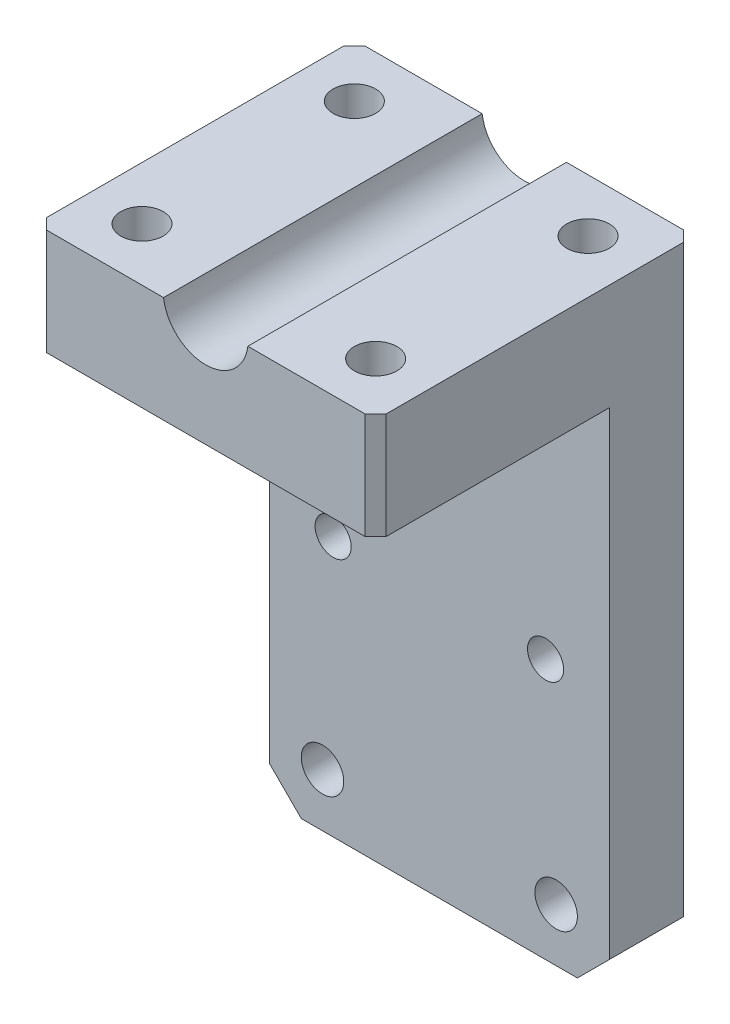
ISO-10303-21;
HEADER;
FILE_DESCRIPTION(('STEP AP214'),'2;1');
FILE_NAME('part.step','',(''),(''),'','','');
FILE_SCHEMA(('AUTOMOTIVE_DESIGN { 1 0 10303 214 1 1 1 1 }'));
ENDSEC;
DATA;
#1=APPLICATION_CONTEXT('core data for automotive mechanical design processes');
#2=APPLICATION_PROTOCOL_DEFINITION('international standard','automotive_design',2000,#1);
#3=PRODUCT_CONTEXT('',#1,'mechanical');
#4=PRODUCT('Part','Part','',(#3));
#5=PRODUCT_RELATED_PRODUCT_CATEGORY('part','',(#4));
#6=PRODUCT_DEFINITION_FORMATION('','',#4);
#7=PRODUCT_DEFINITION_CONTEXT('part definition',#1,'design');
#8=PRODUCT_DEFINITION('design','',#6,#7);
#9=PRODUCT_DEFINITION_SHAPE('','',#8);
#10=(LENGTH_UNIT() NAMED_UNIT(*) SI_UNIT(.MILLI.,.METRE.));
#11=(NAMED_UNIT(*) PLANE_ANGLE_UNIT() SI_UNIT($,.RADIAN.));
#12=(NAMED_UNIT(*) SI_UNIT($,.STERADIAN.) SOLID_ANGLE_UNIT());
#13=UNCERTAINTY_MEASURE_WITH_UNIT(LENGTH_MEASURE(1.E-05),#10,'distance_accuracy_value','');
#14=(GEOMETRIC_REPRESENTATION_CONTEXT(3) GLOBAL_UNCERTAINTY_ASSIGNED_CONTEXT((#13)) GLOBAL_UNIT_ASSIGNED_CONTEXT((#10,
#11,#12)) REPRESENTATION_CONTEXT('',''));
#15=CARTESIAN_POINT('',(0.,0.,0.));
#16=DIRECTION('',(0.,0.,1.));
#17=DIRECTION('',(1.,0.,0.));
#18=AXIS2_PLACEMENT_3D('',#15,#16,#17);
#19=CARTESIAN_POINT('',(-16.,29.,-30.));
#20=DIRECTION('',(0.,1.,0.));
#21=DIRECTION('',(0.,0.,1.));
#22=AXIS2_PLACEMENT_3D('',#19,#20,#21);
#23=PLANE('',#22);
#24=CARTESIAN_POINT('',(11.,29.,-25.));
#25=DIRECTION('',(0.,1.,0.));
#26=DIRECTION('',(0.,0.,1.));
#27=AXIS2_PLACEMENT_3D('',#24,#25,#26);
#28=CIRCLE('',#27,2.);
#29=CARTESIAN_POINT('',(11.,29.,-23.));
#30=VERTEX_POINT('',#29);
#31=EDGE_CURVE('E409',#30,#30,#28,.T.);
#32=ORIENTED_EDGE('',*,*,#31,.F.);
#33=EDGE_LOOP('',(#32));
#34=FACE_BOUND('',#33,.T.);
#35=CARTESIAN_POINT('',(11.,29.,-5.));
#36=DIRECTION('',(0.,1.,0.));
#37=DIRECTION('',(0.,0.,1.));
#38=AXIS2_PLACEMENT_3D('',#35,#36,#37);
#39=CIRCLE('',#38,2.);
#40=CARTESIAN_POINT('',(11.,29.,-3.));
#41=VERTEX_POINT('',#40);
#42=EDGE_CURVE('E419',#41,#41,#39,.T.);
#43=ORIENTED_EDGE('',*,*,#42,.F.);
#44=EDGE_LOOP('',(#43));
#45=FACE_BOUND('',#44,.T.);
#46=DIRECTION('',(0.,0.,1.));
#47=VECTOR('',#46,1.);
#48=CARTESIAN_POINT('',(16.,29.,-30.));
#49=LINE('',#48,#47);
#50=CARTESIAN_POINT('',(16.,29.,-29.));
#51=VERTEX_POINT('',#50);
#52=CARTESIAN_POINT('',(16.,29.,-1.00000000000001));
#53=VERTEX_POINT('',#52);
#54=EDGE_CURVE('E278',#51,#53,#49,.T.);
#55=ORIENTED_EDGE('',*,*,#54,.F.);
#56=DIRECTION('',(0.707106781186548,0.,0.707106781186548));
#57=VECTOR('',#56,1.);
#58=CARTESIAN_POINT('',(-0.500000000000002,29.,-45.5));
#59=LINE('',#58,#57);
#60=CARTESIAN_POINT('',(15.,29.,-30.));
#61=VERTEX_POINT('',#60);
#62=EDGE_CURVE('E368',#51,#61,#59,.F.);
#63=ORIENTED_EDGE('',*,*,#62,.T.);
#64=DIRECTION('',(-1.,0.,0.));
#65=VECTOR('',#64,1.);
#66=CARTESIAN_POINT('',(-16.,29.,-30.));
#67=LINE('',#66,#65);
#68=CARTESIAN_POINT('',(3.96862696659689,29.,-30.));
#69=VERTEX_POINT('',#68);
#70=EDGE_CURVE('E180',#61,#69,#67,.T.);
#71=ORIENTED_EDGE('',*,*,#70,.T.);
#72=DIRECTION('',(0.,0.,-1.));
#73=VECTOR('',#72,1.);
#74=CARTESIAN_POINT('',(3.96862696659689,29.,0.));
#75=LINE('',#74,#73);
#76=CARTESIAN_POINT('',(3.96862696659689,29.,0.));
#77=VERTEX_POINT('',#76);
#78=EDGE_CURVE('E171',#77,#69,#75,.T.);
#79=ORIENTED_EDGE('',*,*,#78,.F.);
#80=DIRECTION('',(-1.,0.,0.));
#81=VECTOR('',#80,1.);
#82=CARTESIAN_POINT('',(-16.,29.,0.));
#83=LINE('',#82,#81);
#84=CARTESIAN_POINT('',(15.,29.,0.));
#85=VERTEX_POINT('',#84);
#86=EDGE_CURVE('E154',#85,#77,#83,.T.);
#87=ORIENTED_EDGE('',*,*,#86,.F.);
#88=DIRECTION('',(0.707106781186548,0.,-0.707106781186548));
#89=VECTOR('',#88,1.);
#90=CARTESIAN_POINT('',(14.5,29.,0.499999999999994));
#91=LINE('',#90,#89);
#92=EDGE_CURVE('E365',#85,#53,#91,.T.);
#93=ORIENTED_EDGE('',*,*,#92,.T.);
#94=EDGE_LOOP('',(#55,#63,#71,#79,#87,#93));
#95=FACE_BOUND('',#94,.T.);
#96=ADVANCED_FACE('F42',(#34,#45,#95),#23,.T.);
#97=CARTESIAN_POINT('',(16.,-29.,-30.));
#98=DIRECTION('',(1.,0.,0.));
#99=DIRECTION('',(0.,0.,-1.));
#100=AXIS2_PLACEMENT_3D('',#97,#98,#99);
#101=PLANE('',#100);
#102=DIRECTION('',(0.,0.,-1.));
#103=VECTOR('',#102,1.);
#104=CARTESIAN_POINT('',(16.,-26.,-30.));
#105=LINE('',#104,#103);
#106=CARTESIAN_POINT('',(16.,-26.,-22.));
#107=VERTEX_POINT('',#106);
#108=CARTESIAN_POINT('',(16.,-26.,-29.));
#109=VERTEX_POINT('',#108);
#110=EDGE_CURVE('E318',#107,#109,#105,.T.);
#111=ORIENTED_EDGE('',*,*,#110,.T.);
#112=DIRECTION('',(0.,1.,0.));
#113=VECTOR('',#112,1.);
#114=CARTESIAN_POINT('',(16.,-29.,-29.));
#115=LINE('',#114,#113);
#116=EDGE_CURVE('E362',#109,#51,#115,.T.);
#117=ORIENTED_EDGE('',*,*,#116,.T.);
#118=ORIENTED_EDGE('',*,*,#54,.T.);
#119=DIRECTION('',(0.,-1.,0.));
#120=VECTOR('',#119,1.);
#121=CARTESIAN_POINT('',(16.,19.,-1.00000000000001));
#122=LINE('',#121,#120);
#123=CARTESIAN_POINT('',(16.,19.,-1.00000000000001));
#124=VERTEX_POINT('',#123);
#125=EDGE_CURVE('E359',#53,#124,#122,.T.);
#126=ORIENTED_EDGE('',*,*,#125,.T.);
#127=DIRECTION('',(0.,0.,1.));
#128=VECTOR('',#127,1.);
#129=CARTESIAN_POINT('',(16.,19.,-22.));
#130=LINE('',#129,#128);
#131=CARTESIAN_POINT('',(16.,19.,-22.));
#132=VERTEX_POINT('',#131);
#133=EDGE_CURVE('E257',#132,#124,#130,.T.);
#134=ORIENTED_EDGE('',*,*,#133,.F.);
#135=DIRECTION('',(0.,1.,0.));
#136=VECTOR('',#135,1.);
#137=CARTESIAN_POINT('',(16.,-29.,-22.));
#138=LINE('',#137,#136);
#139=EDGE_CURVE('E262',#107,#132,#138,.T.);
#140=ORIENTED_EDGE('',*,*,#139,.F.);
#141=EDGE_LOOP('',(#111,#117,#118,#126,#134,#140));
#142=FACE_BOUND('',#141,.T.);
#143=ADVANCED_FACE('F511',(#142),#101,.T.);
#144=CARTESIAN_POINT('',(-16.,-29.,-30.));
#145=DIRECTION('',(0.,-1.,0.));
#146=DIRECTION('',(0.,0.,-1.));
#147=AXIS2_PLACEMENT_3D('',#144,#145,#146);
#148=PLANE('',#147);
#149=DIRECTION('',(0.,0.,-1.));
#150=VECTOR('',#149,1.);
#151=CARTESIAN_POINT('',(-13.,-29.,-30.));
#152=LINE('',#151,#150);
#153=CARTESIAN_POINT('',(-13.,-29.,-22.));
#154=VERTEX_POINT('',#153);
#155=CARTESIAN_POINT('',(-13.,-29.,-29.));
#156=VERTEX_POINT('',#155);
#157=EDGE_CURVE('E314',#154,#156,#152,.T.);
#158=ORIENTED_EDGE('',*,*,#157,.T.);
#159=DIRECTION('',(1.,0.,0.));
#160=VECTOR('',#159,1.);
#161=CARTESIAN_POINT('',(-16.,-29.,-29.));
#162=LINE('',#161,#160);
#163=CARTESIAN_POINT('',(13.,-29.,-29.));
#164=VERTEX_POINT('',#163);
#165=EDGE_CURVE('E353',#156,#164,#162,.T.);
#166=ORIENTED_EDGE('',*,*,#165,.T.);
#167=DIRECTION('',(0.,0.,1.));
#168=VECTOR('',#167,1.);
#169=CARTESIAN_POINT('',(13.,-29.,-30.));
#170=LINE('',#169,#168);
#171=CARTESIAN_POINT('',(13.,-29.,-22.));
#172=VERTEX_POINT('',#171);
#173=EDGE_CURVE('E311',#164,#172,#170,.T.);
#174=ORIENTED_EDGE('',*,*,#173,.T.);
#175=DIRECTION('',(1.,0.,0.));
#176=VECTOR('',#175,1.);
#177=CARTESIAN_POINT('',(-16.,-29.,-22.));
#178=LINE('',#177,#176);
#179=EDGE_CURVE('E267',#154,#172,#178,.T.);
#180=ORIENTED_EDGE('',*,*,#179,.F.);
#181=EDGE_LOOP('',(#158,#166,#174,#180));
#182=FACE_BOUND('',#181,.T.);
#183=ADVANCED_FACE('F499',(#182),#148,.T.);
#184=CARTESIAN_POINT('',(-16.,-29.,-30.));
#185=DIRECTION('',(-1.,0.,0.));
#186=DIRECTION('',(0.,0.,1.));
#187=AXIS2_PLACEMENT_3D('',#184,#185,#186);
#188=PLANE('',#187);
#189=DIRECTION('',(0.,0.,1.));
#190=VECTOR('',#189,1.);
#191=CARTESIAN_POINT('',(-16.,29.,-30.));
#192=LINE('',#191,#190);
#193=CARTESIAN_POINT('',(-16.,29.,-29.));
#194=VERTEX_POINT('',#193);
#195=CARTESIAN_POINT('',(-16.,29.,-1.00000000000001));
#196=VERTEX_POINT('',#195);
#197=EDGE_CURVE('E280',#194,#196,#192,.T.);
#198=ORIENTED_EDGE('',*,*,#197,.F.);
#199=DIRECTION('',(0.,-1.,0.));
#200=VECTOR('',#199,1.);
#201=CARTESIAN_POINT('',(-16.,-29.,-29.));
#202=LINE('',#201,#200);
#203=CARTESIAN_POINT('',(-16.,-26.,-29.));
#204=VERTEX_POINT('',#203);
#205=EDGE_CURVE('E325',#194,#204,#202,.T.);
#206=ORIENTED_EDGE('',*,*,#205,.T.);
#207=DIRECTION('',(0.,0.,1.));
#208=VECTOR('',#207,1.);
#209=CARTESIAN_POINT('',(-16.,-26.,-30.));
#210=LINE('',#209,#208);
#211=CARTESIAN_POINT('',(-16.,-26.,-22.));
#212=VERTEX_POINT('',#211);
#213=EDGE_CURVE('E284',#204,#212,#210,.T.);
#214=ORIENTED_EDGE('',*,*,#213,.T.);
#215=DIRECTION('',(0.,1.,0.));
#216=VECTOR('',#215,1.);
#217=CARTESIAN_POINT('',(-16.,-29.,-22.));
#218=LINE('',#217,#216);
#219=CARTESIAN_POINT('',(-16.,19.,-22.));
#220=VERTEX_POINT('',#219);
#221=EDGE_CURVE('E253',#212,#220,#218,.T.);
#222=ORIENTED_EDGE('',*,*,#221,.T.);
#223=DIRECTION('',(0.,0.,1.));
#224=VECTOR('',#223,1.);
#225=CARTESIAN_POINT('',(-16.,19.,-22.));
#226=LINE('',#225,#224);
#227=CARTESIAN_POINT('',(-16.,19.,-1.00000000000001));
#228=VERTEX_POINT('',#227);
#229=EDGE_CURVE('E256',#220,#228,#226,.T.);
#230=ORIENTED_EDGE('',*,*,#229,.T.);
#231=DIRECTION('',(0.,1.,0.));
#232=VECTOR('',#231,1.);
#233=CARTESIAN_POINT('',(-16.,29.,-1.00000000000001));
#234=LINE('',#233,#232);
#235=EDGE_CURVE('E322',#228,#196,#234,.T.);
#236=ORIENTED_EDGE('',*,*,#235,.T.);
#237=EDGE_LOOP('',(#198,#206,#214,#222,#230,#236));
#238=FACE_BOUND('',#237,.T.);
#239=ADVANCED_FACE('F483',(#238),#188,.T.);
#240=CARTESIAN_POINT('',(-11.,29.,-25.));
#241=DIRECTION('',(0.,1.,0.));
#242=DIRECTION('',(0.,0.,1.));
#243=AXIS2_PLACEMENT_3D('',#240,#241,#242);
#244=CIRCLE('',#243,2.);
#245=CARTESIAN_POINT('',(-11.,29.,-23.));
#246=VERTEX_POINT('',#245);
#247=EDGE_CURVE('E394',#246,#246,#244,.T.);
#248=ORIENTED_EDGE('',*,*,#247,.F.);
#249=EDGE_LOOP('',(#248));
#250=FACE_BOUND('',#249,.T.);
#251=CARTESIAN_POINT('',(-11.,29.,-5.));
#252=DIRECTION('',(0.,1.,0.));
#253=DIRECTION('',(0.,0.,1.));
#254=AXIS2_PLACEMENT_3D('',#251,#252,#253);
#255=CIRCLE('',#254,2.);
#256=CARTESIAN_POINT('',(-11.,29.,-3.));
#257=VERTEX_POINT('',#256);
#258=EDGE_CURVE('E427',#257,#257,#255,.T.);
#259=ORIENTED_EDGE('',*,*,#258,.F.);
#260=EDGE_LOOP('',(#259));
#261=FACE_BOUND('',#260,.T.);
#262=CARTESIAN_POINT('',(-3.96862696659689,29.,-30.));
#263=VERTEX_POINT('',#262);
#264=CARTESIAN_POINT('',(-15.,29.,-30.));
#265=VERTEX_POINT('',#264);
#266=EDGE_CURVE('E165',#263,#265,#67,.T.);
#267=ORIENTED_EDGE('',*,*,#266,.T.);
#268=DIRECTION('',(0.707106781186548,0.,-0.707106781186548));
#269=VECTOR('',#268,1.);
#270=CARTESIAN_POINT('',(-15.5,29.,-29.5));
#271=LINE('',#270,#269);
#272=EDGE_CURVE('E347',#265,#194,#271,.F.);
#273=ORIENTED_EDGE('',*,*,#272,.T.);
#274=ORIENTED_EDGE('',*,*,#197,.T.);
#275=DIRECTION('',(0.707106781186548,0.,0.707106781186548));
#276=VECTOR('',#275,1.);
#277=CARTESIAN_POINT('',(-30.5,29.,-15.5));
#278=LINE('',#277,#276);
#279=CARTESIAN_POINT('',(-15.,29.,0.));
#280=VERTEX_POINT('',#279);
#281=EDGE_CURVE('E344',#196,#280,#278,.T.);
#282=ORIENTED_EDGE('',*,*,#281,.T.);
#283=CARTESIAN_POINT('',(-3.96862696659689,29.,0.));
#284=VERTEX_POINT('',#283);
#285=EDGE_CURVE('E166',#284,#280,#83,.T.);
#286=ORIENTED_EDGE('',*,*,#285,.F.);
#287=DIRECTION('',(0.,0.,-1.));
#288=VECTOR('',#287,1.);
#289=CARTESIAN_POINT('',(-3.96862696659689,29.,0.));
#290=LINE('',#289,#288);
#291=EDGE_CURVE('E174',#263,#284,#290,.F.);
#292=ORIENTED_EDGE('',*,*,#291,.F.);
#293=EDGE_LOOP('',(#267,#273,#274,#282,#286,#292));
#294=FACE_BOUND('',#293,.T.);
#295=ADVANCED_FACE('F440',(#250,#261,#294),#23,.T.);
#296=CARTESIAN_POINT('',(0.,0.,-30.));
#297=DIRECTION('',(0.,0.,-1.));
#298=DIRECTION('',(-1.,0.,0.));
#299=AXIS2_PLACEMENT_3D('',#296,#297,#298);
#300=PLANE('',#299);
#301=DIRECTION('',(-0.707106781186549,0.707106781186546,0.));
#302=VECTOR('',#301,1.);
#303=CARTESIAN_POINT('',(-20.2928932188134,-20.2928932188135,-30.));
#304=LINE('',#303,#302);
#305=CARTESIAN_POINT('',(-12.5857864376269,-28.,-30.));
#306=VERTEX_POINT('',#305);
#307=CARTESIAN_POINT('',(-15.,-25.5857864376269,-30.));
#308=VERTEX_POINT('',#307);
#309=EDGE_CURVE('E338',#306,#308,#304,.T.);
#310=ORIENTED_EDGE('',*,*,#309,.T.);
#311=DIRECTION('',(0.,1.,0.));
#312=VECTOR('',#311,1.);
#313=CARTESIAN_POINT('',(-15.,0.,-30.));
#314=LINE('',#313,#312);
#315=EDGE_CURVE('E341',#308,#265,#314,.T.);
#316=ORIENTED_EDGE('',*,*,#315,.T.);
#317=ORIENTED_EDGE('',*,*,#266,.F.);
#318=CARTESIAN_POINT('',(0.,29.5,-30.));
#319=DIRECTION('',(0.,0.,-1.));
#320=DIRECTION('',(-1.,0.,0.));
#321=AXIS2_PLACEMENT_3D('',#318,#319,#320);
#322=CIRCLE('',#321,4.);
#323=EDGE_CURVE('E176',#69,#263,#322,.T.);
#324=ORIENTED_EDGE('',*,*,#323,.F.);
#325=ORIENTED_EDGE('',*,*,#70,.F.);
#326=DIRECTION('',(0.,-1.,0.));
#327=VECTOR('',#326,1.);
#328=CARTESIAN_POINT('',(15.,0.,-30.));
#329=LINE('',#328,#327);
#330=CARTESIAN_POINT('',(15.,-25.5857864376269,-30.));
#331=VERTEX_POINT('',#330);
#332=EDGE_CURVE('E329',#61,#331,#329,.T.);
#333=ORIENTED_EDGE('',*,*,#332,.T.);
#334=DIRECTION('',(-0.707106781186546,-0.707106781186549,0.));
#335=VECTOR('',#334,1.);
#336=CARTESIAN_POINT('',(20.2928932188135,-20.2928932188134,-30.));
#337=LINE('',#336,#335);
#338=CARTESIAN_POINT('',(12.5857864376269,-28.,-30.));
#339=VERTEX_POINT('',#338);
#340=EDGE_CURVE('E332',#331,#339,#337,.T.);
#341=ORIENTED_EDGE('',*,*,#340,.T.);
#342=DIRECTION('',(-1.,0.,0.));
#343=VECTOR('',#342,1.);
#344=CARTESIAN_POINT('',(0.,-28.,-30.));
#345=LINE('',#344,#343);
#346=EDGE_CURVE('E335',#339,#306,#345,.T.);
#347=ORIENTED_EDGE('',*,*,#346,.T.);
#348=EDGE_LOOP('',(#310,#316,#317,#324,#325,#333,#341,#347));
#349=FACE_BOUND('',#348,.T.);
#350=CARTESIAN_POINT('',(-11.,-24.,-30.));
#351=DIRECTION('',(0.,0.,-1.));
#352=DIRECTION('',(-1.,0.,0.));
#353=AXIS2_PLACEMENT_3D('',#350,#351,#352);
#354=CIRCLE('',#353,2.);
#355=CARTESIAN_POINT('',(-13.,-24.,-30.));
#356=VERTEX_POINT('',#355);
#357=EDGE_CURVE('E182',#356,#356,#354,.T.);
#358=ORIENTED_EDGE('',*,*,#357,.F.);
#359=EDGE_LOOP('',(#358));
#360=FACE_BOUND('',#359,.T.);
#361=CARTESIAN_POINT('',(11.,-24.,-30.));
#362=DIRECTION('',(0.,0.,-1.));
#363=DIRECTION('',(-1.,0.,0.));
#364=AXIS2_PLACEMENT_3D('',#361,#362,#363);
#365=CIRCLE('',#364,2.);
#366=CARTESIAN_POINT('',(9.,-24.,-30.));
#367=VERTEX_POINT('',#366);
#368=EDGE_CURVE('E193',#367,#367,#365,.T.);
#369=ORIENTED_EDGE('',*,*,#368,.F.);
#370=EDGE_LOOP('',(#369));
#371=FACE_BOUND('',#370,.T.);
#372=CARTESIAN_POINT('',(-10.,-4.5,-30.));
#373=DIRECTION('',(0.,0.,-1.));
#374=DIRECTION('',(-1.,0.,0.));
#375=AXIS2_PLACEMENT_3D('',#372,#373,#374);
#376=CIRCLE('',#375,3.5);
#377=CARTESIAN_POINT('',(-13.5,-4.5,-30.));
#378=VERTEX_POINT('',#377);
#379=EDGE_CURVE('E201',#378,#378,#376,.T.);
#380=ORIENTED_EDGE('',*,*,#379,.F.);
#381=EDGE_LOOP('',(#380));
#382=FACE_BOUND('',#381,.T.);
#383=CARTESIAN_POINT('',(10.,-4.5,-30.));
#384=DIRECTION('',(0.,0.,-1.));
#385=DIRECTION('',(-1.,0.,0.));
#386=AXIS2_PLACEMENT_3D('',#383,#384,#385);
#387=CIRCLE('',#386,3.5);
#388=CARTESIAN_POINT('',(6.5,-4.5,-30.));
#389=VERTEX_POINT('',#388);
#390=EDGE_CURVE('E214',#389,#389,#387,.T.);
#391=ORIENTED_EDGE('',*,*,#390,.F.);
#392=EDGE_LOOP('',(#391));
#393=FACE_BOUND('',#392,.T.);
#394=CARTESIAN_POINT('',(-10.,15.5,-30.));
#395=DIRECTION('',(0.,0.,-1.));
#396=DIRECTION('',(-1.,0.,0.));
#397=AXIS2_PLACEMENT_3D('',#394,#395,#396);
#398=CIRCLE('',#397,3.5);
#399=CARTESIAN_POINT('',(-13.5,15.5,-30.));
#400=VERTEX_POINT('',#399);
#401=EDGE_CURVE('E227',#400,#400,#398,.T.);
#402=ORIENTED_EDGE('',*,*,#401,.F.);
#403=EDGE_LOOP('',(#402));
#404=FACE_BOUND('',#403,.T.);
#405=CARTESIAN_POINT('',(10.,15.5,-30.));
#406=DIRECTION('',(0.,0.,-1.));
#407=DIRECTION('',(-1.,0.,0.));
#408=AXIS2_PLACEMENT_3D('',#405,#406,#407);
#409=CIRCLE('',#408,3.5);
#410=CARTESIAN_POINT('',(6.5,15.5,-30.));
#411=VERTEX_POINT('',#410);
#412=EDGE_CURVE('E240',#411,#411,#409,.T.);
#413=ORIENTED_EDGE('',*,*,#412,.F.);
#414=EDGE_LOOP('',(#413));
#415=FACE_BOUND('',#414,.T.);
#416=ADVANCED_FACE('F442',(#349,#360,#371,#382,#393,#404,#415),#300,.T.);
#417=CARTESIAN_POINT('',(0.,0.,0.));
#418=DIRECTION('',(0.,0.,-1.));
#419=DIRECTION('',(-1.,0.,0.));
#420=AXIS2_PLACEMENT_3D('',#417,#418,#419);
#421=PLANE('',#420);
#422=ORIENTED_EDGE('',*,*,#285,.T.);
#423=DIRECTION('',(0.,-1.,0.));
#424=VECTOR('',#423,1.);
#425=CARTESIAN_POINT('',(-15.,19.,0.));
#426=LINE('',#425,#424);
#427=CARTESIAN_POINT('',(-15.,19.,0.));
#428=VERTEX_POINT('',#427);
#429=EDGE_CURVE('E373',#280,#428,#426,.T.);
#430=ORIENTED_EDGE('',*,*,#429,.T.);
#431=DIRECTION('',(1.,0.,0.));
#432=VECTOR('',#431,1.);
#433=CARTESIAN_POINT('',(-16.,19.,0.));
#434=LINE('',#433,#432);
#435=CARTESIAN_POINT('',(15.,19.,0.));
#436=VERTEX_POINT('',#435);
#437=EDGE_CURVE('E271',#428,#436,#434,.T.);
#438=ORIENTED_EDGE('',*,*,#437,.T.);
#439=DIRECTION('',(0.,1.,0.));
#440=VECTOR('',#439,1.);
#441=CARTESIAN_POINT('',(15.,29.,0.));
#442=LINE('',#441,#440);
#443=EDGE_CURVE('E161',#436,#85,#442,.T.);
#444=ORIENTED_EDGE('',*,*,#443,.T.);
#445=ORIENTED_EDGE('',*,*,#86,.T.);
#446=CARTESIAN_POINT('',(0.,29.5,0.));
#447=DIRECTION('',(0.,0.,-1.));
#448=DIRECTION('',(-1.,0.,0.));
#449=AXIS2_PLACEMENT_3D('',#446,#447,#448);
#450=CIRCLE('',#449,4.);
#451=EDGE_CURVE('E158',#77,#284,#450,.T.);
#452=ORIENTED_EDGE('',*,*,#451,.T.);
#453=EDGE_LOOP('',(#422,#430,#438,#444,#445,#452));
#454=FACE_BOUND('',#453,.T.);
#455=ADVANCED_FACE('F157',(#454),#421,.F.);
#456=CARTESIAN_POINT('',(-16.,-29.,-22.));
#457=DIRECTION('',(0.,0.,-1.));
#458=DIRECTION('',(-1.,0.,0.));
#459=AXIS2_PLACEMENT_3D('',#456,#457,#458);
#460=PLANE('',#459);
#461=CARTESIAN_POINT('',(-11.,-24.,-22.));
#462=DIRECTION('',(0.,0.,-1.));
#463=DIRECTION('',(-1.,0.,0.));
#464=AXIS2_PLACEMENT_3D('',#461,#462,#463);
#465=CIRCLE('',#464,1.99999999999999);
#466=CARTESIAN_POINT('',(-13.,-24.,-22.));
#467=VERTEX_POINT('',#466);
#468=EDGE_CURVE('E188',#467,#467,#465,.T.);
#469=ORIENTED_EDGE('',*,*,#468,.T.);
#470=EDGE_LOOP('',(#469));
#471=FACE_BOUND('',#470,.T.);
#472=CARTESIAN_POINT('',(11.,-24.,-22.));
#473=DIRECTION('',(0.,0.,-1.));
#474=DIRECTION('',(-1.,0.,0.));
#475=AXIS2_PLACEMENT_3D('',#472,#473,#474);
#476=CIRCLE('',#475,1.99999999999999);
#477=CARTESIAN_POINT('',(9.00000000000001,-24.,-22.));
#478=VERTEX_POINT('',#477);
#479=EDGE_CURVE('E197',#478,#478,#476,.T.);
#480=ORIENTED_EDGE('',*,*,#479,.T.);
#481=EDGE_LOOP('',(#480));
#482=FACE_BOUND('',#481,.T.);
#483=CARTESIAN_POINT('',(-10.,-4.5,-22.));
#484=DIRECTION('',(0.,0.,-1.));
#485=DIRECTION('',(-1.,0.,0.));
#486=AXIS2_PLACEMENT_3D('',#483,#484,#485);
#487=CIRCLE('',#486,1.7);
#488=CARTESIAN_POINT('',(-11.7,-4.5,-22.));
#489=VERTEX_POINT('',#488);
#490=EDGE_CURVE('E213',#489,#489,#487,.T.);
#491=ORIENTED_EDGE('',*,*,#490,.T.);
#492=EDGE_LOOP('',(#491));
#493=FACE_BOUND('',#492,.T.);
#494=CARTESIAN_POINT('',(10.,-4.5,-22.));
#495=DIRECTION('',(0.,0.,-1.));
#496=DIRECTION('',(-1.,0.,0.));
#497=AXIS2_PLACEMENT_3D('',#494,#495,#496);
#498=CIRCLE('',#497,1.7);
#499=CARTESIAN_POINT('',(8.3,-4.5,-22.));
#500=VERTEX_POINT('',#499);
#501=EDGE_CURVE('E226',#500,#500,#498,.T.);
#502=ORIENTED_EDGE('',*,*,#501,.T.);
#503=EDGE_LOOP('',(#502));
#504=FACE_BOUND('',#503,.T.);
#505=CARTESIAN_POINT('',(-10.,15.5,-22.));
#506=DIRECTION('',(0.,0.,-1.));
#507=DIRECTION('',(-1.,0.,0.));
#508=AXIS2_PLACEMENT_3D('',#505,#506,#507);
#509=CIRCLE('',#508,1.7);
#510=CARTESIAN_POINT('',(-11.7,15.5,-22.));
#511=VERTEX_POINT('',#510);
#512=EDGE_CURVE('E239',#511,#511,#509,.T.);
#513=ORIENTED_EDGE('',*,*,#512,.T.);
#514=EDGE_LOOP('',(#513));
#515=FACE_BOUND('',#514,.T.);
#516=CARTESIAN_POINT('',(10.,15.5,-22.));
#517=DIRECTION('',(0.,0.,-1.));
#518=DIRECTION('',(-1.,0.,0.));
#519=AXIS2_PLACEMENT_3D('',#516,#517,#518);
#520=CIRCLE('',#519,1.7);
#521=CARTESIAN_POINT('',(8.3,15.5,-22.));
#522=VERTEX_POINT('',#521);
#523=EDGE_CURVE('E252',#522,#522,#520,.T.);
#524=ORIENTED_EDGE('',*,*,#523,.T.);
#525=EDGE_LOOP('',(#524));
#526=FACE_BOUND('',#525,.T.);
#527=ORIENTED_EDGE('',*,*,#221,.F.);
#528=DIRECTION('',(-0.707106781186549,0.707106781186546,0.));
#529=VECTOR('',#528,1.);
#530=CARTESIAN_POINT('',(-16.,-26.,-22.));
#531=LINE('',#530,#529);
#532=EDGE_CURVE('E308',#212,#154,#531,.F.);
#533=ORIENTED_EDGE('',*,*,#532,.T.);
#534=ORIENTED_EDGE('',*,*,#179,.T.);
#535=DIRECTION('',(-0.707106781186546,-0.707106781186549,0.));
#536=VECTOR('',#535,1.);
#537=CARTESIAN_POINT('',(13.,-29.,-22.));
#538=LINE('',#537,#536);
#539=EDGE_CURVE('E305',#172,#107,#538,.F.);
#540=ORIENTED_EDGE('',*,*,#539,.T.);
#541=ORIENTED_EDGE('',*,*,#139,.T.);
#542=DIRECTION('',(1.,0.,0.));
#543=VECTOR('',#542,1.);
#544=CARTESIAN_POINT('',(-16.,19.,-22.));
#545=LINE('',#544,#543);
#546=EDGE_CURVE('E261',#220,#132,#545,.T.);
#547=ORIENTED_EDGE('',*,*,#546,.F.);
#548=EDGE_LOOP('',(#527,#533,#534,#540,#541,#547));
#549=FACE_BOUND('',#548,.T.);
#550=ADVANCED_FACE('F621',(#471,#482,#493,#504,#515,#526,#549),#460,.F.);
#551=CARTESIAN_POINT('',(-16.,19.,-22.));
#552=DIRECTION('',(0.,1.,0.));
#553=DIRECTION('',(0.,0.,1.));
#554=AXIS2_PLACEMENT_3D('',#551,#552,#553);
#555=PLANE('',#554);
#556=ORIENTED_EDGE('',*,*,#437,.F.);
#557=DIRECTION('',(-0.707106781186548,0.,-0.707106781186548));
#558=VECTOR('',#557,1.);
#559=CARTESIAN_POINT('',(-15.,19.,0.));
#560=LINE('',#559,#558);
#561=EDGE_CURVE('E11',#428,#228,#560,.T.);
#562=ORIENTED_EDGE('',*,*,#561,.T.);
#563=ORIENTED_EDGE('',*,*,#229,.F.);
#564=ORIENTED_EDGE('',*,*,#546,.T.);
#565=ORIENTED_EDGE('',*,*,#133,.T.);
#566=DIRECTION('',(-0.707106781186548,0.,0.707106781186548));
#567=VECTOR('',#566,1.);
#568=CARTESIAN_POINT('',(15.,19.,0.));
#569=LINE('',#568,#567);
#570=EDGE_CURVE('E53',#124,#436,#569,.T.);
#571=ORIENTED_EDGE('',*,*,#570,.T.);
#572=EDGE_LOOP('',(#556,#562,#563,#564,#565,#571));
#573=FACE_BOUND('',#572,.T.);
#574=ADVANCED_FACE('F617',(#573),#555,.F.);
#575=CARTESIAN_POINT('',(10.,15.5,-30.));
#576=DIRECTION('',(0.,0.,-1.));
#577=DIRECTION('',(-1.,0.,0.));
#578=AXIS2_PLACEMENT_3D('',#575,#576,#577);
#579=CYLINDRICAL_SURFACE('',#578,1.7);
#580=CARTESIAN_POINT('',(10.,15.5,-27.6));
#581=DIRECTION('',(0.,0.,-1.));
#582=DIRECTION('',(-1.,0.,0.));
#583=AXIS2_PLACEMENT_3D('',#580,#581,#582);
#584=CIRCLE('',#583,1.7);
#585=CARTESIAN_POINT('',(8.3,15.5,-27.6));
#586=VERTEX_POINT('',#585);
#587=EDGE_CURVE('E248',#586,#586,#584,.T.);
#588=ORIENTED_EDGE('',*,*,#587,.T.);
#589=EDGE_LOOP('',(#588));
#590=FACE_BOUND('',#589,.T.);
#591=ORIENTED_EDGE('',*,*,#523,.F.);
#592=EDGE_LOOP('',(#591));
#593=FACE_BOUND('',#592,.T.);
#594=ADVANCED_FACE('F613',(#590,#593),#579,.F.);
#595=CARTESIAN_POINT('',(11.7,15.5,-27.6));
#596=DIRECTION('',(0.,0.,1.));
#597=DIRECTION('',(1.,0.,0.));
#598=AXIS2_PLACEMENT_3D('',#595,#596,#597);
#599=PLANE('',#598);
#600=ORIENTED_EDGE('',*,*,#587,.F.);
#601=EDGE_LOOP('',(#600));
#602=FACE_BOUND('',#601,.T.);
#603=CARTESIAN_POINT('',(10.,15.5,-27.6));
#604=DIRECTION('',(0.,0.,-1.));
#605=DIRECTION('',(-1.,0.,0.));
#606=AXIS2_PLACEMENT_3D('',#603,#604,#605);
#607=CIRCLE('',#606,3.5);
#608=CARTESIAN_POINT('',(6.5,15.5,-27.6));
#609=VERTEX_POINT('',#608);
#610=EDGE_CURVE('E244',#609,#609,#607,.T.);
#611=ORIENTED_EDGE('',*,*,#610,.T.);
#612=EDGE_LOOP('',(#611));
#613=FACE_BOUND('',#612,.T.);
#614=ADVANCED_FACE('F609',(#602,#613),#599,.F.);
#615=CARTESIAN_POINT('',(10.,15.5,-30.));
#616=DIRECTION('',(0.,0.,-1.));
#617=DIRECTION('',(-1.,0.,0.));
#618=AXIS2_PLACEMENT_3D('',#615,#616,#617);
#619=CYLINDRICAL_SURFACE('',#618,3.5);
#620=ORIENTED_EDGE('',*,*,#610,.F.);
#621=EDGE_LOOP('',(#620));
#622=FACE_BOUND('',#621,.T.);
#623=ORIENTED_EDGE('',*,*,#412,.T.);
#624=EDGE_LOOP('',(#623));
#625=FACE_BOUND('',#624,.T.);
#626=ADVANCED_FACE('F605',(#622,#625),#619,.F.);
#627=CARTESIAN_POINT('',(-10.,15.5,-30.));
#628=DIRECTION('',(0.,0.,-1.));
#629=DIRECTION('',(-1.,0.,0.));
#630=AXIS2_PLACEMENT_3D('',#627,#628,#629);
#631=CYLINDRICAL_SURFACE('',#630,1.7);
#632=CARTESIAN_POINT('',(-10.,15.5,-27.6));
#633=DIRECTION('',(0.,0.,-1.));
#634=DIRECTION('',(-1.,0.,0.));
#635=AXIS2_PLACEMENT_3D('',#632,#633,#634);
#636=CIRCLE('',#635,1.7);
#637=CARTESIAN_POINT('',(-11.7,15.5,-27.6));
#638=VERTEX_POINT('',#637);
#639=EDGE_CURVE('E235',#638,#638,#636,.T.);
#640=ORIENTED_EDGE('',*,*,#639,.T.);
#641=EDGE_LOOP('',(#640));
#642=FACE_BOUND('',#641,.T.);
#643=ORIENTED_EDGE('',*,*,#512,.F.);
#644=EDGE_LOOP('',(#643));
#645=FACE_BOUND('',#644,.T.);
#646=ADVANCED_FACE('F601',(#642,#645),#631,.F.);
#647=CARTESIAN_POINT('',(-8.3,15.5,-27.6));
#648=DIRECTION('',(0.,0.,1.));
#649=DIRECTION('',(1.,0.,0.));
#650=AXIS2_PLACEMENT_3D('',#647,#648,#649);
#651=PLANE('',#650);
#652=ORIENTED_EDGE('',*,*,#639,.F.);
#653=EDGE_LOOP('',(#652));
#654=FACE_BOUND('',#653,.T.);
#655=CARTESIAN_POINT('',(-10.,15.5,-27.6));
#656=DIRECTION('',(0.,0.,-1.));
#657=DIRECTION('',(-1.,0.,0.));
#658=AXIS2_PLACEMENT_3D('',#655,#656,#657);
#659=CIRCLE('',#658,3.5);
#660=CARTESIAN_POINT('',(-13.5,15.5,-27.6));
#661=VERTEX_POINT('',#660);
#662=EDGE_CURVE('E231',#661,#661,#659,.T.);
#663=ORIENTED_EDGE('',*,*,#662,.T.);
#664=EDGE_LOOP('',(#663));
#665=FACE_BOUND('',#664,.T.);
#666=ADVANCED_FACE('F597',(#654,#665),#651,.F.);
#667=CARTESIAN_POINT('',(-10.,15.5,-30.));
#668=DIRECTION('',(0.,0.,-1.));
#669=DIRECTION('',(-1.,0.,0.));
#670=AXIS2_PLACEMENT_3D('',#667,#668,#669);
#671=CYLINDRICAL_SURFACE('',#670,3.5);
#672=ORIENTED_EDGE('',*,*,#662,.F.);
#673=EDGE_LOOP('',(#672));
#674=FACE_BOUND('',#673,.T.);
#675=ORIENTED_EDGE('',*,*,#401,.T.);
#676=EDGE_LOOP('',(#675));
#677=FACE_BOUND('',#676,.T.);
#678=ADVANCED_FACE('F593',(#674,#677),#671,.F.);
#679=CARTESIAN_POINT('',(10.,-4.5,-30.));
#680=DIRECTION('',(0.,0.,-1.));
#681=DIRECTION('',(-1.,0.,0.));
#682=AXIS2_PLACEMENT_3D('',#679,#680,#681);
#683=CYLINDRICAL_SURFACE('',#682,1.7);
#684=CARTESIAN_POINT('',(10.,-4.5,-27.6));
#685=DIRECTION('',(0.,0.,-1.));
#686=DIRECTION('',(-1.,0.,0.));
#687=AXIS2_PLACEMENT_3D('',#684,#685,#686);
#688=CIRCLE('',#687,1.7);
#689=CARTESIAN_POINT('',(8.3,-4.5,-27.6));
#690=VERTEX_POINT('',#689);
#691=EDGE_CURVE('E222',#690,#690,#688,.T.);
#692=ORIENTED_EDGE('',*,*,#691,.T.);
#693=EDGE_LOOP('',(#692));
#694=FACE_BOUND('',#693,.T.);
#695=ORIENTED_EDGE('',*,*,#501,.F.);
#696=EDGE_LOOP('',(#695));
#697=FACE_BOUND('',#696,.T.);
#698=ADVANCED_FACE('F589',(#694,#697),#683,.F.);
#699=CARTESIAN_POINT('',(11.7,-4.5,-27.6));
#700=DIRECTION('',(0.,0.,1.));
#701=DIRECTION('',(1.,0.,0.));
#702=AXIS2_PLACEMENT_3D('',#699,#700,#701);
#703=PLANE('',#702);
#704=ORIENTED_EDGE('',*,*,#691,.F.);
#705=EDGE_LOOP('',(#704));
#706=FACE_BOUND('',#705,.T.);
#707=CARTESIAN_POINT('',(10.,-4.5,-27.6));
#708=DIRECTION('',(0.,0.,-1.));
#709=DIRECTION('',(-1.,0.,0.));
#710=AXIS2_PLACEMENT_3D('',#707,#708,#709);
#711=CIRCLE('',#710,3.5);
#712=CARTESIAN_POINT('',(6.5,-4.5,-27.6));
#713=VERTEX_POINT('',#712);
#714=EDGE_CURVE('E218',#713,#713,#711,.T.);
#715=ORIENTED_EDGE('',*,*,#714,.T.);
#716=EDGE_LOOP('',(#715));
#717=FACE_BOUND('',#716,.T.);
#718=ADVANCED_FACE('F585',(#706,#717),#703,.F.);
#719=CARTESIAN_POINT('',(10.,-4.5,-30.));
#720=DIRECTION('',(0.,0.,-1.));
#721=DIRECTION('',(-1.,0.,0.));
#722=AXIS2_PLACEMENT_3D('',#719,#720,#721);
#723=CYLINDRICAL_SURFACE('',#722,3.5);
#724=ORIENTED_EDGE('',*,*,#714,.F.);
#725=EDGE_LOOP('',(#724));
#726=FACE_BOUND('',#725,.T.);
#727=ORIENTED_EDGE('',*,*,#390,.T.);
#728=EDGE_LOOP('',(#727));
#729=FACE_BOUND('',#728,.T.);
#730=ADVANCED_FACE('F581',(#726,#729),#723,.F.);
#731=CARTESIAN_POINT('',(-10.,-4.5,-30.));
#732=DIRECTION('',(0.,0.,-1.));
#733=DIRECTION('',(-1.,0.,0.));
#734=AXIS2_PLACEMENT_3D('',#731,#732,#733);
#735=CYLINDRICAL_SURFACE('',#734,1.7);
#736=CARTESIAN_POINT('',(-10.,-4.5,-27.6));
#737=DIRECTION('',(0.,0.,-1.));
#738=DIRECTION('',(-1.,0.,0.));
#739=AXIS2_PLACEMENT_3D('',#736,#737,#738);
#740=CIRCLE('',#739,1.7);
#741=CARTESIAN_POINT('',(-11.7,-4.5,-27.6));
#742=VERTEX_POINT('',#741);
#743=EDGE_CURVE('E209',#742,#742,#740,.T.);
#744=ORIENTED_EDGE('',*,*,#743,.T.);
#745=EDGE_LOOP('',(#744));
#746=FACE_BOUND('',#745,.T.);
#747=ORIENTED_EDGE('',*,*,#490,.F.);
#748=EDGE_LOOP('',(#747));
#749=FACE_BOUND('',#748,.T.);
#750=ADVANCED_FACE('F577',(#746,#749),#735,.F.);
#751=CARTESIAN_POINT('',(-8.3,-4.5,-27.6));
#752=DIRECTION('',(0.,0.,1.));
#753=DIRECTION('',(1.,0.,0.));
#754=AXIS2_PLACEMENT_3D('',#751,#752,#753);
#755=PLANE('',#754);
#756=ORIENTED_EDGE('',*,*,#743,.F.);
#757=EDGE_LOOP('',(#756));
#758=FACE_BOUND('',#757,.T.);
#759=CARTESIAN_POINT('',(-10.,-4.5,-27.6));
#760=DIRECTION('',(0.,0.,-1.));
#761=DIRECTION('',(-1.,0.,0.));
#762=AXIS2_PLACEMENT_3D('',#759,#760,#761);
#763=CIRCLE('',#762,3.5);
#764=CARTESIAN_POINT('',(-13.5,-4.5,-27.6));
#765=VERTEX_POINT('',#764);
#766=EDGE_CURVE('E205',#765,#765,#763,.T.);
#767=ORIENTED_EDGE('',*,*,#766,.T.);
#768=EDGE_LOOP('',(#767));
#769=FACE_BOUND('',#768,.T.);
#770=ADVANCED_FACE('F573',(#758,#769),#755,.F.);
#771=CARTESIAN_POINT('',(-10.,-4.5,-30.));
#772=DIRECTION('',(0.,0.,-1.));
#773=DIRECTION('',(-1.,0.,0.));
#774=AXIS2_PLACEMENT_3D('',#771,#772,#773);
#775=CYLINDRICAL_SURFACE('',#774,3.5);
#776=ORIENTED_EDGE('',*,*,#766,.F.);
#777=EDGE_LOOP('',(#776));
#778=FACE_BOUND('',#777,.T.);
#779=ORIENTED_EDGE('',*,*,#379,.T.);
#780=EDGE_LOOP('',(#779));
#781=FACE_BOUND('',#780,.T.);
#782=ADVANCED_FACE('F569',(#778,#781),#775,.F.);
#783=CARTESIAN_POINT('',(11.,-24.,-30.));
#784=DIRECTION('',(0.,0.,-1.));
#785=DIRECTION('',(-1.,0.,0.));
#786=AXIS2_PLACEMENT_3D('',#783,#784,#785);
#787=CYLINDRICAL_SURFACE('',#786,1.99999999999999);
#788=ORIENTED_EDGE('',*,*,#368,.T.);
#789=EDGE_LOOP('',(#788));
#790=FACE_BOUND('',#789,.T.);
#791=ORIENTED_EDGE('',*,*,#479,.F.);
#792=EDGE_LOOP('',(#791));
#793=FACE_BOUND('',#792,.T.);
#794=ADVANCED_FACE('F565',(#790,#793),#787,.F.);
#795=CARTESIAN_POINT('',(-11.,-24.,-30.));
#796=DIRECTION('',(0.,0.,-1.));
#797=DIRECTION('',(-1.,0.,0.));
#798=AXIS2_PLACEMENT_3D('',#795,#796,#797);
#799=CYLINDRICAL_SURFACE('',#798,1.99999999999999);
#800=ORIENTED_EDGE('',*,*,#357,.T.);
#801=EDGE_LOOP('',(#800));
#802=FACE_BOUND('',#801,.T.);
#803=ORIENTED_EDGE('',*,*,#468,.F.);
#804=EDGE_LOOP('',(#803));
#805=FACE_BOUND('',#804,.T.);
#806=ADVANCED_FACE('F562',(#802,#805),#799,.F.);
#807=CARTESIAN_POINT('',(-16.,-26.,-30.));
#808=DIRECTION('',(0.707106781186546,0.707106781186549,0.));
#809=DIRECTION('',(0.,0.,1.));
#810=AXIS2_PLACEMENT_3D('',#807,#808,#809);
#811=PLANE('',#810);
#812=ORIENTED_EDGE('',*,*,#213,.F.);
#813=DIRECTION('',(-0.707106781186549,0.707106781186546,0.));
#814=VECTOR('',#813,1.);
#815=CARTESIAN_POINT('',(-16.,-26.,-29.));
#816=LINE('',#815,#814);
#817=EDGE_CURVE('E350',#204,#156,#816,.F.);
#818=ORIENTED_EDGE('',*,*,#817,.T.);
#819=ORIENTED_EDGE('',*,*,#157,.F.);
#820=ORIENTED_EDGE('',*,*,#532,.F.);
#821=EDGE_LOOP('',(#812,#818,#819,#820));
#822=FACE_BOUND('',#821,.T.);
#823=ADVANCED_FACE('F495',(#822),#811,.F.);
#824=CARTESIAN_POINT('',(13.,-29.,-30.));
#825=DIRECTION('',(-0.707106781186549,0.707106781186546,0.));
#826=DIRECTION('',(0.,0.,1.));
#827=AXIS2_PLACEMENT_3D('',#824,#825,#826);
#828=PLANE('',#827);
#829=ORIENTED_EDGE('',*,*,#173,.F.);
#830=DIRECTION('',(-0.707106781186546,-0.707106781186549,0.));
#831=VECTOR('',#830,1.);
#832=CARTESIAN_POINT('',(13.,-29.,-29.));
#833=LINE('',#832,#831);
#834=EDGE_CURVE('E356',#164,#109,#833,.F.);
#835=ORIENTED_EDGE('',*,*,#834,.T.);
#836=ORIENTED_EDGE('',*,*,#110,.F.);
#837=ORIENTED_EDGE('',*,*,#539,.F.);
#838=EDGE_LOOP('',(#829,#835,#836,#837));
#839=FACE_BOUND('',#838,.T.);
#840=ADVANCED_FACE('F506',(#839),#828,.F.);
#841=CARTESIAN_POINT('',(0.,29.5,0.));
#842=DIRECTION('',(0.,0.,-1.));
#843=DIRECTION('',(-1.,0.,0.));
#844=AXIS2_PLACEMENT_3D('',#841,#842,#843);
#845=CYLINDRICAL_SURFACE('',#844,4.);
#846=ORIENTED_EDGE('',*,*,#78,.T.);
#847=ORIENTED_EDGE('',*,*,#323,.T.);
#848=ORIENTED_EDGE('',*,*,#291,.T.);
#849=ORIENTED_EDGE('',*,*,#451,.F.);
#850=EDGE_LOOP('',(#846,#847,#848,#849));
#851=FACE_BOUND('',#850,.T.);
#852=ADVANCED_FACE('F170',(#851),#845,.F.);
#853=CARTESIAN_POINT('',(-11.,22.,-5.));
#854=DIRECTION('',(0.,-1.,0.));
#855=DIRECTION('',(0.,0.,-1.));
#856=AXIS2_PLACEMENT_3D('',#853,#854,#855);
#857=PLANE('',#856);
#858=CARTESIAN_POINT('',(-11.,22.,-5.));
#859=DIRECTION('',(0.,1.,0.));
#860=DIRECTION('',(0.,0.,1.));
#861=AXIS2_PLACEMENT_3D('',#858,#859,#860);
#862=CIRCLE('',#861,2.);
#863=CARTESIAN_POINT('',(-11.,22.,-3.));
#864=VERTEX_POINT('',#863);
#865=EDGE_CURVE('E431',#864,#864,#862,.T.);
#866=ORIENTED_EDGE('',*,*,#865,.T.);
#867=EDGE_LOOP('',(#866));
#868=FACE_BOUND('',#867,.T.);
#869=ADVANCED_FACE('F545',(#868),#857,.F.);
#870=CARTESIAN_POINT('',(-11.,29.,-5.));
#871=DIRECTION('',(0.,1.,0.));
#872=DIRECTION('',(0.,0.,1.));
#873=AXIS2_PLACEMENT_3D('',#870,#871,#872);
#874=CYLINDRICAL_SURFACE('',#873,2.);
#875=ORIENTED_EDGE('',*,*,#865,.F.);
#876=EDGE_LOOP('',(#875));
#877=FACE_BOUND('',#876,.T.);
#878=ORIENTED_EDGE('',*,*,#258,.T.);
#879=EDGE_LOOP('',(#878));
#880=FACE_BOUND('',#879,.T.);
#881=ADVANCED_FACE('F542',(#877,#880),#874,.F.);
#882=CARTESIAN_POINT('',(11.,22.,-5.));
#883=DIRECTION('',(0.,-1.,0.));
#884=DIRECTION('',(0.,0.,-1.));
#885=AXIS2_PLACEMENT_3D('',#882,#883,#884);
#886=PLANE('',#885);
#887=CARTESIAN_POINT('',(11.,22.,-5.));
#888=DIRECTION('',(0.,1.,0.));
#889=DIRECTION('',(0.,0.,1.));
#890=AXIS2_PLACEMENT_3D('',#887,#888,#889);
#891=CIRCLE('',#890,2.);
#892=CARTESIAN_POINT('',(11.,22.,-3.));
#893=VERTEX_POINT('',#892);
#894=EDGE_CURVE('E423',#893,#893,#891,.T.);
#895=ORIENTED_EDGE('',*,*,#894,.T.);
#896=EDGE_LOOP('',(#895));
#897=FACE_BOUND('',#896,.T.);
#898=ADVANCED_FACE('F544',(#897),#886,.F.);
#899=CARTESIAN_POINT('',(11.,29.,-5.));
#900=DIRECTION('',(0.,1.,0.));
#901=DIRECTION('',(0.,0.,1.));
#902=AXIS2_PLACEMENT_3D('',#899,#900,#901);
#903=CYLINDRICAL_SURFACE('',#902,2.);
#904=ORIENTED_EDGE('',*,*,#894,.F.);
#905=EDGE_LOOP('',(#904));
#906=FACE_BOUND('',#905,.T.);
#907=ORIENTED_EDGE('',*,*,#42,.T.);
#908=EDGE_LOOP('',(#907));
#909=FACE_BOUND('',#908,.T.);
#910=ADVANCED_FACE('F552',(#906,#909),#903,.F.);
#911=CARTESIAN_POINT('',(11.,22.,-25.));
#912=DIRECTION('',(0.,-1.,0.));
#913=DIRECTION('',(0.,0.,-1.));
#914=AXIS2_PLACEMENT_3D('',#911,#912,#913);
#915=PLANE('',#914);
#916=CARTESIAN_POINT('',(11.,22.,-25.));
#917=DIRECTION('',(0.,1.,0.));
#918=DIRECTION('',(0.,0.,1.));
#919=AXIS2_PLACEMENT_3D('',#916,#917,#918);
#920=CIRCLE('',#919,2.);
#921=CARTESIAN_POINT('',(11.,22.,-23.));
#922=VERTEX_POINT('',#921);
#923=EDGE_CURVE('E415',#922,#922,#920,.T.);
#924=ORIENTED_EDGE('',*,*,#923,.T.);
#925=EDGE_LOOP('',(#924));
#926=FACE_BOUND('',#925,.T.);
#927=ADVANCED_FACE('F796',(#926),#915,.F.);
#928=CARTESIAN_POINT('',(11.,29.,-25.));
#929=DIRECTION('',(0.,1.,0.));
#930=DIRECTION('',(0.,0.,1.));
#931=AXIS2_PLACEMENT_3D('',#928,#929,#930);
#932=CYLINDRICAL_SURFACE('',#931,2.);
#933=ORIENTED_EDGE('',*,*,#923,.F.);
#934=EDGE_LOOP('',(#933));
#935=FACE_BOUND('',#934,.T.);
#936=ORIENTED_EDGE('',*,*,#31,.T.);
#937=EDGE_LOOP('',(#936));
#938=FACE_BOUND('',#937,.T.);
#939=ADVANCED_FACE('F805',(#935,#938),#932,.F.);
#940=CARTESIAN_POINT('',(-11.,22.,-25.));
#941=DIRECTION('',(0.,-1.,0.));
#942=DIRECTION('',(0.,0.,-1.));
#943=AXIS2_PLACEMENT_3D('',#940,#941,#942);
#944=PLANE('',#943);
#945=CARTESIAN_POINT('',(-11.,22.,-25.));
#946=DIRECTION('',(0.,1.,0.));
#947=DIRECTION('',(0.,0.,1.));
#948=AXIS2_PLACEMENT_3D('',#945,#946,#947);
#949=CIRCLE('',#948,2.);
#950=CARTESIAN_POINT('',(-11.,22.,-23.));
#951=VERTEX_POINT('',#950);
#952=EDGE_CURVE('E402',#951,#951,#949,.T.);
#953=ORIENTED_EDGE('',*,*,#952,.T.);
#954=EDGE_LOOP('',(#953));
#955=FACE_BOUND('',#954,.T.);
#956=ADVANCED_FACE('F815',(#955),#944,.F.);
#957=CARTESIAN_POINT('',(-11.,29.,-25.));
#958=DIRECTION('',(0.,1.,0.));
#959=DIRECTION('',(0.,0.,1.));
#960=AXIS2_PLACEMENT_3D('',#957,#958,#959);
#961=CYLINDRICAL_SURFACE('',#960,2.);
#962=ORIENTED_EDGE('',*,*,#952,.F.);
#963=EDGE_LOOP('',(#962));
#964=FACE_BOUND('',#963,.T.);
#965=ORIENTED_EDGE('',*,*,#247,.T.);
#966=EDGE_LOOP('',(#965));
#967=FACE_BOUND('',#966,.T.);
#968=ADVANCED_FACE('F825',(#964,#967),#961,.F.);
#969=CARTESIAN_POINT('',(16.,-29.,-29.));
#970=DIRECTION('',(-0.707106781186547,0.,0.707106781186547));
#971=DIRECTION('',(0.,1.,0.));
#972=AXIS2_PLACEMENT_3D('',#969,#970,#971);
#973=PLANE('',#972);
#974=ORIENTED_EDGE('',*,*,#62,.F.);
#975=ORIENTED_EDGE('',*,*,#116,.F.);
#976=DIRECTION('',(0.678598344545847,-0.281084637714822,0.678598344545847));
#977=VECTOR('',#976,1.);
#978=CARTESIAN_POINT('',(16.5722307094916,-26.2370257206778,-28.4277692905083));
#979=LINE('',#978,#977);
#980=EDGE_CURVE('E47',#331,#109,#979,.T.);
#981=ORIENTED_EDGE('',*,*,#980,.F.);
#982=ORIENTED_EDGE('',*,*,#332,.F.);
#983=EDGE_LOOP('',(#974,#975,#981,#982));
#984=FACE_BOUND('',#983,.T.);
#985=ADVANCED_FACE('F515',(#984),#973,.F.);
#986=CARTESIAN_POINT('',(20.2928932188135,-20.2928932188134,-30.));
#987=DIRECTION('',(0.5,-0.499999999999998,-0.707106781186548));
#988=DIRECTION('',(0.707106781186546,0.707106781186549,0.));
#989=AXIS2_PLACEMENT_3D('',#986,#987,#988);
#990=PLANE('',#989);
#991=ORIENTED_EDGE('',*,*,#980,.T.);
#992=ORIENTED_EDGE('',*,*,#834,.F.);
#993=DIRECTION('',(0.281084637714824,-0.678598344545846,0.678598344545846));
#994=VECTOR('',#993,1.);
#995=CARTESIAN_POINT('',(11.7246328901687,-25.9209914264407,-32.0790085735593));
#996=LINE('',#995,#994);
#997=EDGE_CURVE('E384',#339,#164,#996,.T.);
#998=ORIENTED_EDGE('',*,*,#997,.F.);
#999=ORIENTED_EDGE('',*,*,#340,.F.);
#1000=EDGE_LOOP('',(#991,#992,#998,#999));
#1001=FACE_BOUND('',#1000,.T.);
#1002=ADVANCED_FACE('F503',(#1001),#990,.T.);
#1003=CARTESIAN_POINT('',(-16.,-29.,-29.));
#1004=DIRECTION('',(0.,0.707106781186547,0.707106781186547));
#1005=DIRECTION('',(1.,0.,0.));
#1006=AXIS2_PLACEMENT_3D('',#1003,#1004,#1005);
#1007=PLANE('',#1006);
#1008=ORIENTED_EDGE('',*,*,#997,.T.);
#1009=ORIENTED_EDGE('',*,*,#165,.F.);
#1010=DIRECTION('',(-0.281084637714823,-0.678598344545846,0.678598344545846));
#1011=VECTOR('',#1010,1.);
#1012=CARTESIAN_POINT('',(-13.2370257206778,-29.5722307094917,-28.4277692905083));
#1013=LINE('',#1012,#1011);
#1014=EDGE_CURVE('E381',#306,#156,#1013,.T.);
#1015=ORIENTED_EDGE('',*,*,#1014,.F.);
#1016=ORIENTED_EDGE('',*,*,#346,.F.);
#1017=EDGE_LOOP('',(#1008,#1009,#1015,#1016));
#1018=FACE_BOUND('',#1017,.T.);
#1019=ADVANCED_FACE('F501',(#1018),#1007,.F.);
#1020=CARTESIAN_POINT('',(-20.2928932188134,-20.2928932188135,-30.));
#1021=DIRECTION('',(-0.499999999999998,-0.5,-0.707106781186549));
#1022=DIRECTION('',(0.707106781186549,-0.707106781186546,0.));
#1023=AXIS2_PLACEMENT_3D('',#1020,#1021,#1022);
#1024=PLANE('',#1023);
#1025=ORIENTED_EDGE('',*,*,#1014,.T.);
#1026=ORIENTED_EDGE('',*,*,#817,.F.);
#1027=DIRECTION('',(-0.678598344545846,-0.281084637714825,0.678598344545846));
#1028=VECTOR('',#1027,1.);
#1029=CARTESIAN_POINT('',(-16.4277692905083,-26.1771878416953,-28.5722307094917));
#1030=LINE('',#1029,#1028);
#1031=EDGE_CURVE('E378',#308,#204,#1030,.T.);
#1032=ORIENTED_EDGE('',*,*,#1031,.F.);
#1033=ORIENTED_EDGE('',*,*,#309,.F.);
#1034=EDGE_LOOP('',(#1025,#1026,#1032,#1033));
#1035=FACE_BOUND('',#1034,.T.);
#1036=ADVANCED_FACE('F491',(#1035),#1024,.T.);
#1037=CARTESIAN_POINT('',(-16.,-29.,-29.));
#1038=DIRECTION('',(0.707106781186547,0.,0.707106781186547));
#1039=DIRECTION('',(0.,-1.,0.));
#1040=AXIS2_PLACEMENT_3D('',#1037,#1038,#1039);
#1041=PLANE('',#1040);
#1042=ORIENTED_EDGE('',*,*,#272,.F.);
#1043=ORIENTED_EDGE('',*,*,#315,.F.);
#1044=ORIENTED_EDGE('',*,*,#1031,.T.);
#1045=ORIENTED_EDGE('',*,*,#205,.F.);
#1046=EDGE_LOOP('',(#1042,#1043,#1044,#1045));
#1047=FACE_BOUND('',#1046,.T.);
#1048=ADVANCED_FACE('F486',(#1047),#1041,.F.);
#1049=CARTESIAN_POINT('',(-15.,0.,0.));
#1050=DIRECTION('',(-0.707106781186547,0.,0.707106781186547));
#1051=DIRECTION('',(0.,1.,0.));
#1052=AXIS2_PLACEMENT_3D('',#1049,#1050,#1051);
#1053=PLANE('',#1052);
#1054=ORIENTED_EDGE('',*,*,#281,.F.);
#1055=ORIENTED_EDGE('',*,*,#235,.F.);
#1056=ORIENTED_EDGE('',*,*,#561,.F.);
#1057=ORIENTED_EDGE('',*,*,#429,.F.);
#1058=EDGE_LOOP('',(#1054,#1055,#1056,#1057));
#1059=FACE_BOUND('',#1058,.T.);
#1060=ADVANCED_FACE('F479',(#1059),#1053,.T.);
#1061=CARTESIAN_POINT('',(15.,0.,0.));
#1062=DIRECTION('',(0.707106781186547,0.,0.707106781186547));
#1063=DIRECTION('',(0.,-1.,0.));
#1064=AXIS2_PLACEMENT_3D('',#1061,#1062,#1063);
#1065=PLANE('',#1064);
#1066=ORIENTED_EDGE('',*,*,#570,.F.);
#1067=ORIENTED_EDGE('',*,*,#125,.F.);
#1068=ORIENTED_EDGE('',*,*,#92,.F.);
#1069=ORIENTED_EDGE('',*,*,#443,.F.);
#1070=EDGE_LOOP('',(#1066,#1067,#1068,#1069));
#1071=FACE_BOUND('',#1070,.T.);
#1072=ADVANCED_FACE('F45',(#1071),#1065,.T.);
#1073=CLOSED_SHELL('',(#96,#143,#183,#239,#295,#416,#455,#550,#574,#594,#614,#626,#646,#666,
#678,#698,#718,#730,#750,#770,#782,#794,#806,#823,#840,#852,#869,#881,#898,#910,#927,#939,#956,
#968,#985,#1002,#1019,#1036,#1048,#1060,#1072));
#1074=MANIFOLD_SOLID_BREP('B2',#1073);
#1075=ADVANCED_BREP_SHAPE_REPRESENTATION('',(#18,#1074),#14);
#1076=SHAPE_DEFINITION_REPRESENTATION(#9,#1075);
ENDSEC;
END-ISO-10303-21;
